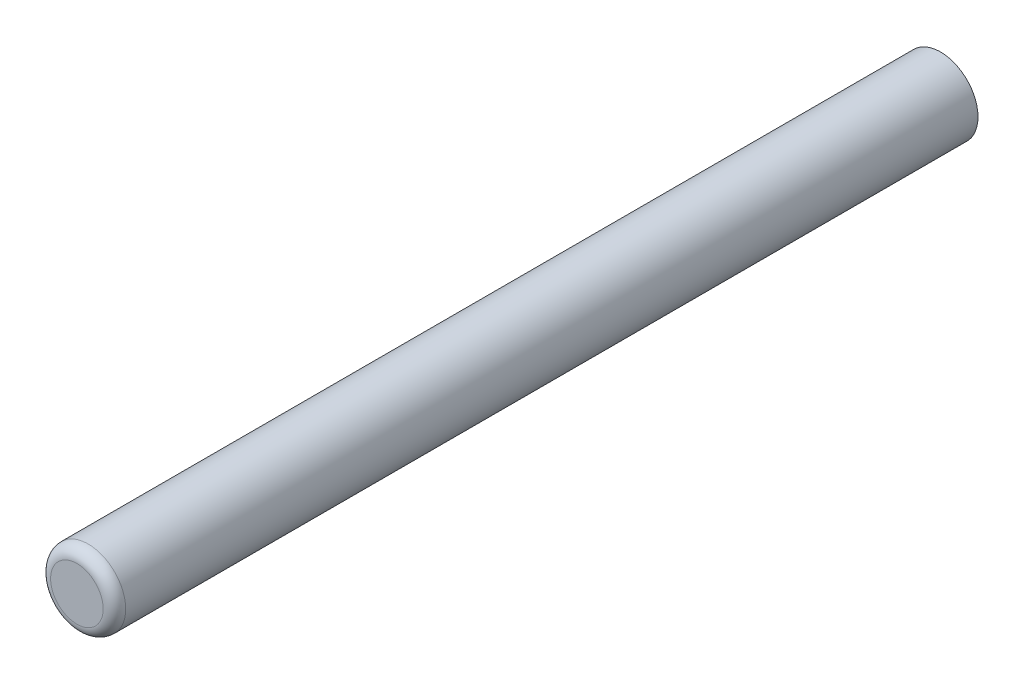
from build123d import *

# Parameters (mm, degrees)
ESQUISSE1_R      = 1
EXTRUSION1_DEPTH = 23
CONG_2_R         = 0.3


with BuildPart() as part:
    # Esquisse1 → Extrusion1 (new body)
    with BuildSketch(Plane.XY):
        Circle(ESQUISSE1_R)
    extrude(amount=EXTRUSION1_DEPTH)

    # Cong_2
    cong_2_edges = [part.edges().sort_by_distance(p)[0] for p in [
        (-1, 0, 23),
    ]]
    fillet(cong_2_edges, radius=CONG_2_R)


solid = part.part
